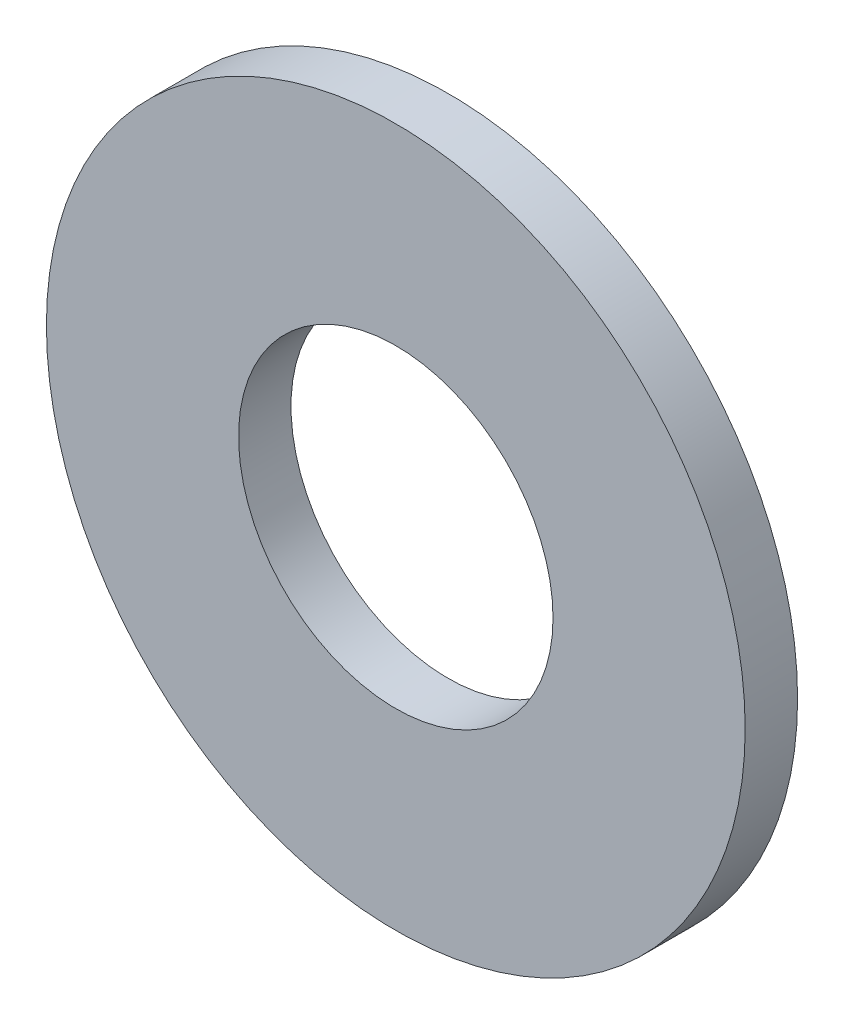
ISO-10303-21;
HEADER;
FILE_DESCRIPTION(('STEP AP214'),'2;1');
FILE_NAME('part.step','',(''),(''),'','','');
FILE_SCHEMA(('AUTOMOTIVE_DESIGN { 1 0 10303 214 1 1 1 1 }'));
ENDSEC;
DATA;
#1=APPLICATION_CONTEXT('core data for automotive mechanical design processes');
#2=APPLICATION_PROTOCOL_DEFINITION('international standard','automotive_design',2000,#1);
#3=PRODUCT_CONTEXT('',#1,'mechanical');
#4=PRODUCT('Part','Part','',(#3));
#5=PRODUCT_RELATED_PRODUCT_CATEGORY('part','',(#4));
#6=PRODUCT_DEFINITION_FORMATION('','',#4);
#7=PRODUCT_DEFINITION_CONTEXT('part definition',#1,'design');
#8=PRODUCT_DEFINITION('design','',#6,#7);
#9=PRODUCT_DEFINITION_SHAPE('','',#8);
#10=(LENGTH_UNIT() NAMED_UNIT(*) SI_UNIT(.MILLI.,.METRE.));
#11=(NAMED_UNIT(*) PLANE_ANGLE_UNIT() SI_UNIT($,.RADIAN.));
#12=(NAMED_UNIT(*) SI_UNIT($,.STERADIAN.) SOLID_ANGLE_UNIT());
#13=UNCERTAINTY_MEASURE_WITH_UNIT(LENGTH_MEASURE(1.E-05),#10,'distance_accuracy_value','');
#14=(GEOMETRIC_REPRESENTATION_CONTEXT(3) GLOBAL_UNCERTAINTY_ASSIGNED_CONTEXT((#13)) GLOBAL_UNIT_ASSIGNED_CONTEXT((#10,
#11,#12)) REPRESENTATION_CONTEXT('',''));
#15=CARTESIAN_POINT('',(0.,0.,0.));
#16=DIRECTION('',(0.,0.,1.));
#17=DIRECTION('',(1.,0.,0.));
#18=AXIS2_PLACEMENT_3D('',#15,#16,#17);
#19=CARTESIAN_POINT('',(0.,0.,-0.3));
#20=DIRECTION('',(0.,0.,1.));
#21=DIRECTION('',(1.,0.,0.));
#22=AXIS2_PLACEMENT_3D('',#19,#20,#21);
#23=CYLINDRICAL_SURFACE('',#22,2.);
#24=CARTESIAN_POINT('',(0.,0.,-0.3));
#25=DIRECTION('',(0.,0.,1.));
#26=DIRECTION('',(1.,0.,0.));
#27=AXIS2_PLACEMENT_3D('',#24,#25,#26);
#28=CIRCLE('',#27,2.);
#29=CARTESIAN_POINT('',(2.,0.,-0.3));
#30=VERTEX_POINT('',#29);
#31=EDGE_CURVE('E10',#30,#30,#28,.T.);
#32=ORIENTED_EDGE('',*,*,#31,.T.);
#33=EDGE_LOOP('',(#32));
#34=FACE_BOUND('',#33,.T.);
#35=CARTESIAN_POINT('',(0.,0.,0.));
#36=DIRECTION('',(0.,0.,1.));
#37=DIRECTION('',(1.,0.,0.));
#38=AXIS2_PLACEMENT_3D('',#35,#36,#37);
#39=CIRCLE('',#38,2.);
#40=CARTESIAN_POINT('',(2.,0.,0.));
#41=VERTEX_POINT('',#40);
#42=EDGE_CURVE('E31',#41,#41,#39,.T.);
#43=ORIENTED_EDGE('',*,*,#42,.F.);
#44=EDGE_LOOP('',(#43));
#45=FACE_BOUND('',#44,.T.);
#46=ADVANCED_FACE('F28',(#34,#45),#23,.T.);
#47=CARTESIAN_POINT('',(0.,0.,-0.3));
#48=DIRECTION('',(0.,0.,1.));
#49=DIRECTION('',(1.,0.,0.));
#50=AXIS2_PLACEMENT_3D('',#47,#48,#49);
#51=PLANE('',#50);
#52=CARTESIAN_POINT('',(0.,0.,-0.3));
#53=DIRECTION('',(0.,0.,1.));
#54=DIRECTION('',(1.,0.,0.));
#55=AXIS2_PLACEMENT_3D('',#52,#53,#54);
#56=CIRCLE('',#55,0.9);
#57=CARTESIAN_POINT('',(0.9,0.,-0.3));
#58=VERTEX_POINT('',#57);
#59=EDGE_CURVE('E38',#58,#58,#56,.T.);
#60=ORIENTED_EDGE('',*,*,#59,.T.);
#61=EDGE_LOOP('',(#60));
#62=FACE_BOUND('',#61,.T.);
#63=ORIENTED_EDGE('',*,*,#31,.F.);
#64=EDGE_LOOP('',(#63));
#65=FACE_BOUND('',#64,.T.);
#66=ADVANCED_FACE('F46',(#62,#65),#51,.F.);
#67=CARTESIAN_POINT('',(0.,0.,0.));
#68=DIRECTION('',(0.,0.,1.));
#69=DIRECTION('',(1.,0.,0.));
#70=AXIS2_PLACEMENT_3D('',#67,#68,#69);
#71=PLANE('',#70);
#72=CARTESIAN_POINT('',(0.,0.,0.));
#73=DIRECTION('',(0.,0.,1.));
#74=DIRECTION('',(1.,0.,0.));
#75=AXIS2_PLACEMENT_3D('',#72,#73,#74);
#76=CIRCLE('',#75,0.9);
#77=CARTESIAN_POINT('',(0.9,0.,0.));
#78=VERTEX_POINT('',#77);
#79=EDGE_CURVE('E40',#78,#78,#76,.T.);
#80=ORIENTED_EDGE('',*,*,#79,.F.);
#81=EDGE_LOOP('',(#80));
#82=FACE_BOUND('',#81,.T.);
#83=ORIENTED_EDGE('',*,*,#42,.T.);
#84=EDGE_LOOP('',(#83));
#85=FACE_BOUND('',#84,.T.);
#86=ADVANCED_FACE('F52',(#82,#85),#71,.T.);
#87=CARTESIAN_POINT('',(0.,0.,-0.3));
#88=DIRECTION('',(0.,0.,1.));
#89=DIRECTION('',(1.,0.,0.));
#90=AXIS2_PLACEMENT_3D('',#87,#88,#89);
#91=CYLINDRICAL_SURFACE('',#90,0.9);
#92=ORIENTED_EDGE('',*,*,#59,.F.);
#93=EDGE_LOOP('',(#92));
#94=FACE_BOUND('',#93,.T.);
#95=ORIENTED_EDGE('',*,*,#79,.T.);
#96=EDGE_LOOP('',(#95));
#97=FACE_BOUND('',#96,.T.);
#98=ADVANCED_FACE('F49',(#94,#97),#91,.F.);
#99=CLOSED_SHELL('',(#46,#66,#86,#98));
#100=MANIFOLD_SOLID_BREP('B2',#99);
#101=ADVANCED_BREP_SHAPE_REPRESENTATION('',(#18,#100),#14);
#102=SHAPE_DEFINITION_REPRESENTATION(#9,#101);
ENDSEC;
END-ISO-10303-21;
